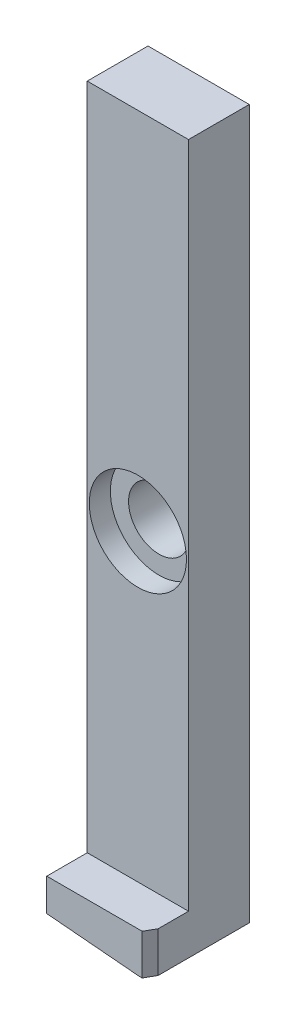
ISO-10303-21;
HEADER;
FILE_DESCRIPTION(('STEP AP214'),'2;1');
FILE_NAME('part.step','',(''),(''),'','','');
FILE_SCHEMA(('AUTOMOTIVE_DESIGN { 1 0 10303 214 1 1 1 1 }'));
ENDSEC;
DATA;
#1=APPLICATION_CONTEXT('core data for automotive mechanical design processes');
#2=APPLICATION_PROTOCOL_DEFINITION('international standard','automotive_design',2000,#1);
#3=PRODUCT_CONTEXT('',#1,'mechanical');
#4=PRODUCT('Part','Part','',(#3));
#5=PRODUCT_RELATED_PRODUCT_CATEGORY('part','',(#4));
#6=PRODUCT_DEFINITION_FORMATION('','',#4);
#7=PRODUCT_DEFINITION_CONTEXT('part definition',#1,'design');
#8=PRODUCT_DEFINITION('design','',#6,#7);
#9=PRODUCT_DEFINITION_SHAPE('','',#8);
#10=(LENGTH_UNIT() NAMED_UNIT(*) SI_UNIT(.MILLI.,.METRE.));
#11=(NAMED_UNIT(*) PLANE_ANGLE_UNIT() SI_UNIT($,.RADIAN.));
#12=(NAMED_UNIT(*) SI_UNIT($,.STERADIAN.) SOLID_ANGLE_UNIT());
#13=UNCERTAINTY_MEASURE_WITH_UNIT(LENGTH_MEASURE(1.E-05),#10,'distance_accuracy_value','');
#14=(GEOMETRIC_REPRESENTATION_CONTEXT(3) GLOBAL_UNCERTAINTY_ASSIGNED_CONTEXT((#13)) GLOBAL_UNIT_ASSIGNED_CONTEXT((#10,
#11,#12)) REPRESENTATION_CONTEXT('',''));
#15=CARTESIAN_POINT('',(0.,0.,0.));
#16=DIRECTION('',(0.,0.,1.));
#17=DIRECTION('',(1.,0.,0.));
#18=AXIS2_PLACEMENT_3D('',#15,#16,#17);
#19=CARTESIAN_POINT('',(-174.371,113.792,9.525));
#20=DIRECTION('',(1.,0.,0.));
#21=DIRECTION('',(0.,0.,-1.));
#22=AXIS2_PLACEMENT_3D('',#19,#20,#21);
#23=PLANE('',#22);
#24=DIRECTION('',(0.,-1.,0.));
#25=VECTOR('',#24,1.);
#26=CARTESIAN_POINT('',(-174.371,113.792,0.));
#27=LINE('',#26,#25);
#28=CARTESIAN_POINT('',(-174.371,113.792,0.));
#29=VERTEX_POINT('',#28);
#30=CARTESIAN_POINT('',(-174.371,3.93264394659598,0.));
#31=VERTEX_POINT('',#30);
#32=EDGE_CURVE('E202',#29,#31,#27,.T.);
#33=ORIENTED_EDGE('',*,*,#32,.T.);
#34=DIRECTION('',(0.,0.,1.));
#35=VECTOR('',#34,1.);
#36=CARTESIAN_POINT('',(-174.371,3.93264394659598,9.525));
#37=LINE('',#36,#35);
#38=CARTESIAN_POINT('',(-174.371,3.93264394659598,15.875));
#39=VERTEX_POINT('',#38);
#40=EDGE_CURVE('E151',#31,#39,#37,.T.);
#41=ORIENTED_EDGE('',*,*,#40,.T.);
#42=DIRECTION('',(0.,-1.,0.));
#43=VECTOR('',#42,1.);
#44=CARTESIAN_POINT('',(-174.371,9.01699999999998,15.875));
#45=LINE('',#44,#43);
#46=CARTESIAN_POINT('',(-174.371,9.01699999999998,15.875));
#47=VERTEX_POINT('',#46);
#48=EDGE_CURVE('E166',#47,#39,#45,.T.);
#49=ORIENTED_EDGE('',*,*,#48,.F.);
#50=DIRECTION('',(0.,0.,-1.));
#51=VECTOR('',#50,1.);
#52=CARTESIAN_POINT('',(-174.371,9.01699999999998,15.875));
#53=LINE('',#52,#51);
#54=CARTESIAN_POINT('',(-174.371,9.01699999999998,9.525));
#55=VERTEX_POINT('',#54);
#56=EDGE_CURVE('E178',#47,#55,#53,.T.);
#57=ORIENTED_EDGE('',*,*,#56,.T.);
#58=DIRECTION('',(0.,-1.,0.));
#59=VECTOR('',#58,1.);
#60=CARTESIAN_POINT('',(-174.371,113.792,9.525));
#61=LINE('',#60,#59);
#62=CARTESIAN_POINT('',(-174.371,113.792,9.525));
#63=VERTEX_POINT('',#62);
#64=EDGE_CURVE('E203',#63,#55,#61,.T.);
#65=ORIENTED_EDGE('',*,*,#64,.F.);
#66=DIRECTION('',(0.,0.,-1.));
#67=VECTOR('',#66,1.);
#68=CARTESIAN_POINT('',(-174.371,113.792,9.525));
#69=LINE('',#68,#67);
#70=EDGE_CURVE('E213',#63,#29,#69,.T.);
#71=ORIENTED_EDGE('',*,*,#70,.T.);
#72=EDGE_LOOP('',(#33,#41,#49,#57,#65,#71));
#73=FACE_BOUND('',#72,.T.);
#74=ADVANCED_FACE('F75',(#73),#23,.F.);
#75=CARTESIAN_POINT('',(-174.371,2.667,9.525));
#76=DIRECTION('',(0.,1.,0.));
#77=DIRECTION('',(0.,0.,1.));
#78=AXIS2_PLACEMENT_3D('',#75,#76,#77);
#79=PLANE('',#78);
#80=DIRECTION('',(0.,0.,-1.));
#81=VECTOR('',#80,1.);
#82=CARTESIAN_POINT('',(-158.496,2.667,9.525));
#83=LINE('',#82,#81);
#84=CARTESIAN_POINT('',(-158.496,2.667,14.2875));
#85=VERTEX_POINT('',#84);
#86=CARTESIAN_POINT('',(-158.496,2.667,0.));
#87=VERTEX_POINT('',#86);
#88=EDGE_CURVE('E229',#85,#87,#83,.T.);
#89=ORIENTED_EDGE('',*,*,#88,.F.);
#90=DIRECTION('',(-0.499999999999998,0.,0.86602540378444));
#91=VECTOR('',#90,1.);
#92=CARTESIAN_POINT('',(-159.412543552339,2.667,15.875));
#93=LINE('',#92,#91);
#94=CARTESIAN_POINT('',(-159.412543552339,2.667,15.875));
#95=VERTEX_POINT('',#94);
#96=EDGE_CURVE('E13',#85,#95,#93,.T.);
#97=ORIENTED_EDGE('',*,*,#96,.T.);
#98=DIRECTION('',(1.,0.,0.));
#99=VECTOR('',#98,1.);
#100=CARTESIAN_POINT('',(-159.904623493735,2.667,15.875));
#101=LINE('',#100,#99);
#102=CARTESIAN_POINT('',(-159.904623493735,2.667,15.875));
#103=VERTEX_POINT('',#102);
#104=EDGE_CURVE('E154',#103,#95,#101,.T.);
#105=ORIENTED_EDGE('',*,*,#104,.F.);
#106=DIRECTION('',(0.,0.,1.));
#107=VECTOR('',#106,1.);
#108=CARTESIAN_POINT('',(-159.904623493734,2.667,0.));
#109=LINE('',#108,#107);
#110=CARTESIAN_POINT('',(-159.904623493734,2.667,0.));
#111=VERTEX_POINT('',#110);
#112=EDGE_CURVE('E140',#111,#103,#109,.T.);
#113=ORIENTED_EDGE('',*,*,#112,.F.);
#114=DIRECTION('',(1.,0.,0.));
#115=VECTOR('',#114,1.);
#116=CARTESIAN_POINT('',(-174.371,2.667,0.));
#117=LINE('',#116,#115);
#118=EDGE_CURVE('E217',#111,#87,#117,.T.);
#119=ORIENTED_EDGE('',*,*,#118,.T.);
#120=EDGE_LOOP('',(#89,#97,#105,#113,#119));
#121=FACE_BOUND('',#120,.T.);
#122=ADVANCED_FACE('F155',(#121),#79,.F.);
#123=CARTESIAN_POINT('',(-158.496,113.792,9.525));
#124=DIRECTION('',(-1.,0.,0.));
#125=DIRECTION('',(0.,0.,1.));
#126=AXIS2_PLACEMENT_3D('',#123,#124,#125);
#127=PLANE('',#126);
#128=DIRECTION('',(0.,0.,-1.));
#129=VECTOR('',#128,1.);
#130=CARTESIAN_POINT('',(-158.496,9.017,15.875));
#131=LINE('',#130,#129);
#132=CARTESIAN_POINT('',(-158.496,9.017,14.2875));
#133=VERTEX_POINT('',#132);
#134=CARTESIAN_POINT('',(-158.496,9.017,9.525));
#135=VERTEX_POINT('',#134);
#136=EDGE_CURVE('E183',#133,#135,#131,.T.);
#137=ORIENTED_EDGE('',*,*,#136,.F.);
#138=DIRECTION('',(0.,-1.,0.));
#139=VECTOR('',#138,1.);
#140=CARTESIAN_POINT('',(-158.496,2.667,14.2875));
#141=LINE('',#140,#139);
#142=EDGE_CURVE('E85',#133,#85,#141,.T.);
#143=ORIENTED_EDGE('',*,*,#142,.T.);
#144=ORIENTED_EDGE('',*,*,#88,.T.);
#145=DIRECTION('',(0.,1.,0.));
#146=VECTOR('',#145,1.);
#147=CARTESIAN_POINT('',(-158.496,113.792,0.));
#148=LINE('',#147,#146);
#149=CARTESIAN_POINT('',(-158.496,113.792,0.));
#150=VERTEX_POINT('',#149);
#151=EDGE_CURVE('E218',#87,#150,#148,.T.);
#152=ORIENTED_EDGE('',*,*,#151,.T.);
#153=DIRECTION('',(0.,0.,-1.));
#154=VECTOR('',#153,1.);
#155=CARTESIAN_POINT('',(-158.496,113.792,9.525));
#156=LINE('',#155,#154);
#157=CARTESIAN_POINT('',(-158.496,113.792,9.525));
#158=VERTEX_POINT('',#157);
#159=EDGE_CURVE('E226',#158,#150,#156,.T.);
#160=ORIENTED_EDGE('',*,*,#159,.F.);
#161=DIRECTION('',(0.,1.,0.));
#162=VECTOR('',#161,1.);
#163=CARTESIAN_POINT('',(-158.496,113.792,9.525));
#164=LINE('',#163,#162);
#165=EDGE_CURVE('E206',#135,#158,#164,.T.);
#166=ORIENTED_EDGE('',*,*,#165,.F.);
#167=EDGE_LOOP('',(#137,#143,#144,#152,#160,#166));
#168=FACE_BOUND('',#167,.T.);
#169=ADVANCED_FACE('F291',(#168),#127,.F.);
#170=CARTESIAN_POINT('',(-174.371,113.792,9.525));
#171=DIRECTION('',(0.,-1.,0.));
#172=DIRECTION('',(1.,0.,0.));
#173=AXIS2_PLACEMENT_3D('',#170,#171,#172);
#174=PLANE('',#173);
#175=DIRECTION('',(-1.,0.,0.));
#176=VECTOR('',#175,1.);
#177=CARTESIAN_POINT('',(-174.371,113.792,0.));
#178=LINE('',#177,#176);
#179=EDGE_CURVE('E207',#150,#29,#178,.T.);
#180=ORIENTED_EDGE('',*,*,#179,.T.);
#181=ORIENTED_EDGE('',*,*,#70,.F.);
#182=DIRECTION('',(-1.,0.,0.));
#183=VECTOR('',#182,1.);
#184=CARTESIAN_POINT('',(-174.371,113.792,9.525));
#185=LINE('',#184,#183);
#186=EDGE_CURVE('E210',#158,#63,#185,.T.);
#187=ORIENTED_EDGE('',*,*,#186,.F.);
#188=ORIENTED_EDGE('',*,*,#159,.T.);
#189=EDGE_LOOP('',(#180,#181,#187,#188));
#190=FACE_BOUND('',#189,.T.);
#191=ADVANCED_FACE('F320',(#190),#174,.F.);
#192=CARTESIAN_POINT('',(0.,0.,9.525));
#193=DIRECTION('',(0.,0.,1.));
#194=DIRECTION('',(1.,0.,0.));
#195=AXIS2_PLACEMENT_3D('',#192,#193,#194);
#196=PLANE('',#195);
#197=DIRECTION('',(-1.,0.,0.));
#198=VECTOR('',#197,1.);
#199=CARTESIAN_POINT('',(-174.371,9.01699999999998,9.525));
#200=LINE('',#199,#198);
#201=EDGE_CURVE('E168',#135,#55,#200,.T.);
#202=ORIENTED_EDGE('',*,*,#201,.F.);
#203=ORIENTED_EDGE('',*,*,#165,.T.);
#204=ORIENTED_EDGE('',*,*,#186,.T.);
#205=ORIENTED_EDGE('',*,*,#64,.T.);
#206=EDGE_LOOP('',(#202,#203,#204,#205));
#207=FACE_BOUND('',#206,.T.);
#208=CARTESIAN_POINT('',(-166.4335,56.642,9.525));
#209=DIRECTION('',(0.,0.,1.));
#210=DIRECTION('',(1.,0.,0.));
#211=AXIS2_PLACEMENT_3D('',#208,#209,#210);
#212=CIRCLE('',#211,7.62);
#213=CARTESIAN_POINT('',(-158.8135,56.642,9.525));
#214=VERTEX_POINT('',#213);
#215=EDGE_CURVE('E198',#214,#214,#212,.T.);
#216=ORIENTED_EDGE('',*,*,#215,.F.);
#217=EDGE_LOOP('',(#216));
#218=FACE_BOUND('',#217,.T.);
#219=ADVANCED_FACE('F317',(#207,#218),#196,.T.);
#220=CARTESIAN_POINT('',(0.,0.,0.));
#221=DIRECTION('',(0.,0.,1.));
#222=DIRECTION('',(1.,0.,0.));
#223=AXIS2_PLACEMENT_3D('',#220,#221,#222);
#224=PLANE('',#223);
#225=CARTESIAN_POINT('',(-166.4335,56.642,0.));
#226=DIRECTION('',(0.,0.,1.));
#227=DIRECTION('',(1.,0.,0.));
#228=AXIS2_PLACEMENT_3D('',#225,#226,#227);
#229=CIRCLE('',#228,4.7625);
#230=CARTESIAN_POINT('',(-161.671,56.642,0.));
#231=VERTEX_POINT('',#230);
#232=EDGE_CURVE('E186',#231,#231,#229,.T.);
#233=ORIENTED_EDGE('',*,*,#232,.T.);
#234=EDGE_LOOP('',(#233));
#235=FACE_BOUND('',#234,.T.);
#236=ORIENTED_EDGE('',*,*,#118,.F.);
#237=DIRECTION('',(-0.996194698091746,0.0871557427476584,0.));
#238=VECTOR('',#237,1.);
#239=CARTESIAN_POINT('',(-0.983095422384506,-11.2368320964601,0.));
#240=LINE('',#239,#238);
#241=EDGE_CURVE('E146',#111,#31,#240,.T.);
#242=ORIENTED_EDGE('',*,*,#241,.T.);
#243=ORIENTED_EDGE('',*,*,#32,.F.);
#244=ORIENTED_EDGE('',*,*,#179,.F.);
#245=ORIENTED_EDGE('',*,*,#151,.F.);
#246=EDGE_LOOP('',(#236,#242,#243,#244,#245));
#247=FACE_BOUND('',#246,.T.);
#248=ADVANCED_FACE('F278',(#235,#247),#224,.F.);
#249=CARTESIAN_POINT('',(-166.4335,56.642,9.525));
#250=DIRECTION('',(0.,0.,1.));
#251=DIRECTION('',(1.,0.,0.));
#252=AXIS2_PLACEMENT_3D('',#249,#250,#251);
#253=CYLINDRICAL_SURFACE('',#252,7.62);
#254=CARTESIAN_POINT('',(-166.4335,56.642,6.223));
#255=DIRECTION('',(0.,0.,1.));
#256=DIRECTION('',(1.,0.,0.));
#257=AXIS2_PLACEMENT_3D('',#254,#255,#256);
#258=CIRCLE('',#257,7.62);
#259=CARTESIAN_POINT('',(-158.8135,56.642,6.223));
#260=VERTEX_POINT('',#259);
#261=EDGE_CURVE('E194',#260,#260,#258,.T.);
#262=ORIENTED_EDGE('',*,*,#261,.F.);
#263=EDGE_LOOP('',(#262));
#264=FACE_BOUND('',#263,.T.);
#265=ORIENTED_EDGE('',*,*,#215,.T.);
#266=EDGE_LOOP('',(#265));
#267=FACE_BOUND('',#266,.T.);
#268=ADVANCED_FACE('F308',(#264,#267),#253,.F.);
#269=CARTESIAN_POINT('',(-161.671,56.642,6.223));
#270=DIRECTION('',(0.,0.,-1.));
#271=DIRECTION('',(-1.,0.,0.));
#272=AXIS2_PLACEMENT_3D('',#269,#270,#271);
#273=PLANE('',#272);
#274=CARTESIAN_POINT('',(-166.4335,56.642,6.223));
#275=DIRECTION('',(0.,0.,1.));
#276=DIRECTION('',(1.,0.,0.));
#277=AXIS2_PLACEMENT_3D('',#274,#275,#276);
#278=CIRCLE('',#277,4.7625);
#279=CARTESIAN_POINT('',(-161.671,56.642,6.223));
#280=VERTEX_POINT('',#279);
#281=EDGE_CURVE('E190',#280,#280,#278,.T.);
#282=ORIENTED_EDGE('',*,*,#281,.F.);
#283=EDGE_LOOP('',(#282));
#284=FACE_BOUND('',#283,.T.);
#285=ORIENTED_EDGE('',*,*,#261,.T.);
#286=EDGE_LOOP('',(#285));
#287=FACE_BOUND('',#286,.T.);
#288=ADVANCED_FACE('F302',(#284,#287),#273,.F.);
#289=CARTESIAN_POINT('',(-166.4335,56.642,9.525));
#290=DIRECTION('',(0.,0.,1.));
#291=DIRECTION('',(1.,0.,0.));
#292=AXIS2_PLACEMENT_3D('',#289,#290,#291);
#293=CYLINDRICAL_SURFACE('',#292,4.7625);
#294=ORIENTED_EDGE('',*,*,#232,.F.);
#295=EDGE_LOOP('',(#294));
#296=FACE_BOUND('',#295,.T.);
#297=ORIENTED_EDGE('',*,*,#281,.T.);
#298=EDGE_LOOP('',(#297));
#299=FACE_BOUND('',#298,.T.);
#300=ADVANCED_FACE('F296',(#296,#299),#293,.F.);
#301=CARTESIAN_POINT('',(-174.647719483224,3.95685376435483,0.));
#302=DIRECTION('',(0.0871557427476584,0.996194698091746,0.));
#303=DIRECTION('',(-0.996194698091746,0.0871557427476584,0.));
#304=AXIS2_PLACEMENT_3D('',#301,#302,#303);
#305=PLANE('',#304);
#306=ORIENTED_EDGE('',*,*,#112,.T.);
#307=DIRECTION('',(0.996194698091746,-0.0871557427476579,0.));
#308=VECTOR('',#307,1.);
#309=CARTESIAN_POINT('',(-174.371,3.93264394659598,15.875));
#310=LINE('',#309,#308);
#311=EDGE_CURVE('E144',#39,#103,#310,.T.);
#312=ORIENTED_EDGE('',*,*,#311,.F.);
#313=ORIENTED_EDGE('',*,*,#40,.F.);
#314=ORIENTED_EDGE('',*,*,#241,.F.);
#315=EDGE_LOOP('',(#306,#312,#313,#314));
#316=FACE_BOUND('',#315,.T.);
#317=ADVANCED_FACE('F142',(#316),#305,.F.);
#318=CARTESIAN_POINT('',(-174.371,9.01699999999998,15.875));
#319=DIRECTION('',(0.,-1.,0.));
#320=DIRECTION('',(1.,0.,0.));
#321=AXIS2_PLACEMENT_3D('',#318,#319,#320);
#322=PLANE('',#321);
#323=DIRECTION('',(-1.,0.,0.));
#324=VECTOR('',#323,1.);
#325=CARTESIAN_POINT('',(-174.371,9.01699999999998,15.875));
#326=LINE('',#325,#324);
#327=CARTESIAN_POINT('',(-159.412543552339,9.017,15.875));
#328=VERTEX_POINT('',#327);
#329=EDGE_CURVE('E161',#328,#47,#326,.T.);
#330=ORIENTED_EDGE('',*,*,#329,.F.);
#331=DIRECTION('',(0.499999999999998,0.,-0.86602540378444));
#332=VECTOR('',#331,1.);
#333=CARTESIAN_POINT('',(-159.412543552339,9.017,15.875));
#334=LINE('',#333,#332);
#335=EDGE_CURVE('E99',#328,#133,#334,.T.);
#336=ORIENTED_EDGE('',*,*,#335,.T.);
#337=ORIENTED_EDGE('',*,*,#136,.T.);
#338=ORIENTED_EDGE('',*,*,#201,.T.);
#339=ORIENTED_EDGE('',*,*,#56,.F.);
#340=EDGE_LOOP('',(#330,#336,#337,#338,#339));
#341=FACE_BOUND('',#340,.T.);
#342=ADVANCED_FACE('F272',(#341),#322,.F.);
#343=CARTESIAN_POINT('',(0.,0.,15.875));
#344=DIRECTION('',(0.,0.,1.));
#345=DIRECTION('',(1.,0.,0.));
#346=AXIS2_PLACEMENT_3D('',#343,#344,#345);
#347=PLANE('',#346);
#348=ORIENTED_EDGE('',*,*,#104,.T.);
#349=DIRECTION('',(0.,1.,0.));
#350=VECTOR('',#349,1.);
#351=CARTESIAN_POINT('',(-159.412543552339,9.017,15.875));
#352=LINE('',#351,#350);
#353=EDGE_CURVE('E233',#95,#328,#352,.T.);
#354=ORIENTED_EDGE('',*,*,#353,.T.);
#355=ORIENTED_EDGE('',*,*,#329,.T.);
#356=ORIENTED_EDGE('',*,*,#48,.T.);
#357=ORIENTED_EDGE('',*,*,#311,.T.);
#358=EDGE_LOOP('',(#348,#354,#355,#356,#357));
#359=FACE_BOUND('',#358,.T.);
#360=ADVANCED_FACE('F164',(#359),#347,.T.);
#361=CARTESIAN_POINT('',(-159.412543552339,0.,15.875));
#362=DIRECTION('',(0.86602540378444,0.,0.499999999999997));
#363=DIRECTION('',(0.,-1.,0.));
#364=AXIS2_PLACEMENT_3D('',#361,#362,#363);
#365=PLANE('',#364);
#366=ORIENTED_EDGE('',*,*,#96,.F.);
#367=ORIENTED_EDGE('',*,*,#142,.F.);
#368=ORIENTED_EDGE('',*,*,#335,.F.);
#369=ORIENTED_EDGE('',*,*,#353,.F.);
#370=EDGE_LOOP('',(#366,#367,#368,#369));
#371=FACE_BOUND('',#370,.T.);
#372=ADVANCED_FACE('F78',(#371),#365,.T.);
#373=CLOSED_SHELL('',(#74,#122,#169,#191,#219,#248,#268,#288,#300,#317,#342,#360,#372));
#374=MANIFOLD_SOLID_BREP('B2',#373);
#375=ADVANCED_BREP_SHAPE_REPRESENTATION('',(#18,#374),#14);
#376=SHAPE_DEFINITION_REPRESENTATION(#9,#375);
ENDSEC;
END-ISO-10303-21;
